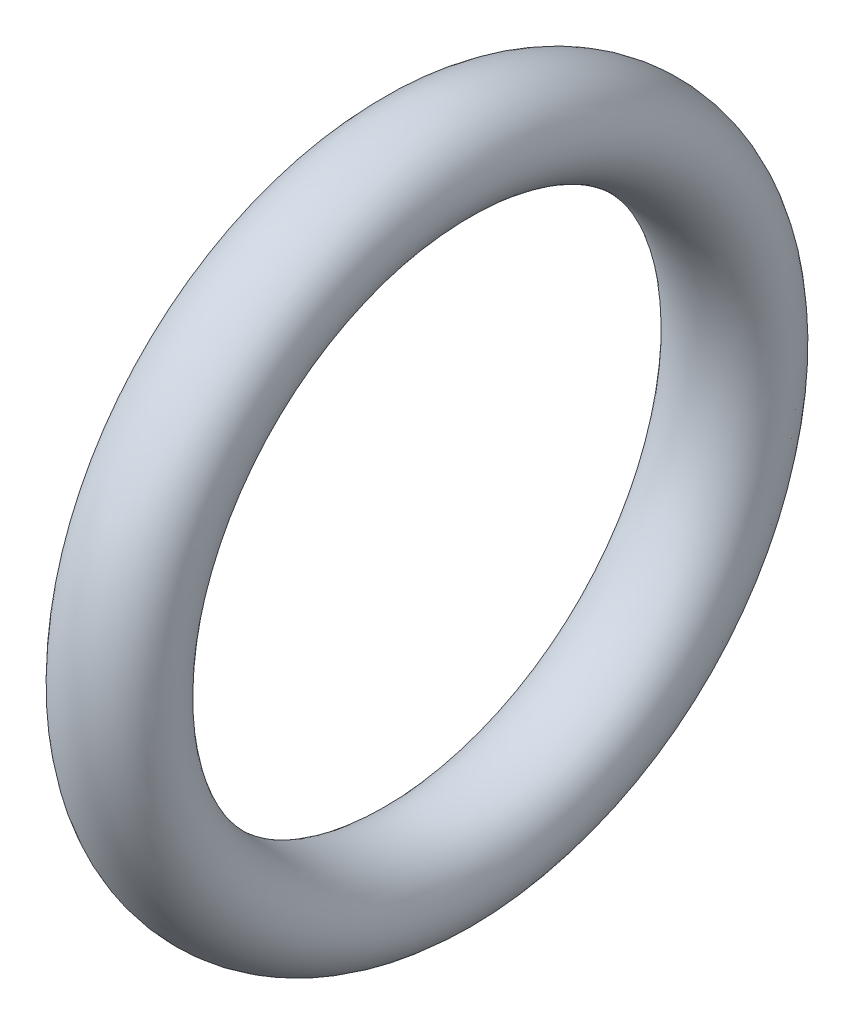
ISO-10303-21;
HEADER;
FILE_DESCRIPTION(('STEP AP214'),'2;1');
FILE_NAME('part.step','',(''),(''),'','','');
FILE_SCHEMA(('AUTOMOTIVE_DESIGN { 1 0 10303 214 1 1 1 1 }'));
ENDSEC;
DATA;
#1=APPLICATION_CONTEXT('core data for automotive mechanical design processes');
#2=APPLICATION_PROTOCOL_DEFINITION('international standard','automotive_design',2000,#1);
#3=PRODUCT_CONTEXT('',#1,'mechanical');
#4=PRODUCT('Part','Part','',(#3));
#5=PRODUCT_RELATED_PRODUCT_CATEGORY('part','',(#4));
#6=PRODUCT_DEFINITION_FORMATION('','',#4);
#7=PRODUCT_DEFINITION_CONTEXT('part definition',#1,'design');
#8=PRODUCT_DEFINITION('design','',#6,#7);
#9=PRODUCT_DEFINITION_SHAPE('','',#8);
#10=(LENGTH_UNIT() NAMED_UNIT(*) SI_UNIT(.MILLI.,.METRE.));
#11=(NAMED_UNIT(*) PLANE_ANGLE_UNIT() SI_UNIT($,.RADIAN.));
#12=(NAMED_UNIT(*) SI_UNIT($,.STERADIAN.) SOLID_ANGLE_UNIT());
#13=UNCERTAINTY_MEASURE_WITH_UNIT(LENGTH_MEASURE(1.E-05),#10,'distance_accuracy_value','');
#14=(GEOMETRIC_REPRESENTATION_CONTEXT(3) GLOBAL_UNCERTAINTY_ASSIGNED_CONTEXT((#13)) GLOBAL_UNIT_ASSIGNED_CONTEXT((#10,
#11,#12)) REPRESENTATION_CONTEXT('',''));
#15=CARTESIAN_POINT('',(0.,0.,0.));
#16=DIRECTION('',(0.,0.,1.));
#17=DIRECTION('',(1.,0.,0.));
#18=AXIS2_PLACEMENT_3D('',#15,#16,#17);
#19=CARTESIAN_POINT('',(0.,-5.2,0.));
#20=DIRECTION('',(0.,0.,-1.));
#21=DIRECTION('',(1.,0.,0.));
#22=AXIS2_PLACEMENT_3D('',#19,#20,#21);
#23=ELLIPSE('',#22,0.95,0.8);
#24=CARTESIAN_POINT('',(-5.34886384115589,0.,0.));
#25=DIRECTION('',(-1.,0.,0.));
#26=AXIS1_PLACEMENT('',#24,#25);
#27=SURFACE_OF_REVOLUTION('',#23,#26);
#28=ADVANCED_FACE('F28',(),#27,.T.);
#29=CLOSED_SHELL('',(#28));
#30=MANIFOLD_SOLID_BREP('B2',#29);
#31=ADVANCED_BREP_SHAPE_REPRESENTATION('',(#18,#30),#14);
#32=SHAPE_DEFINITION_REPRESENTATION(#9,#31);
ENDSEC;
END-ISO-10303-21;
